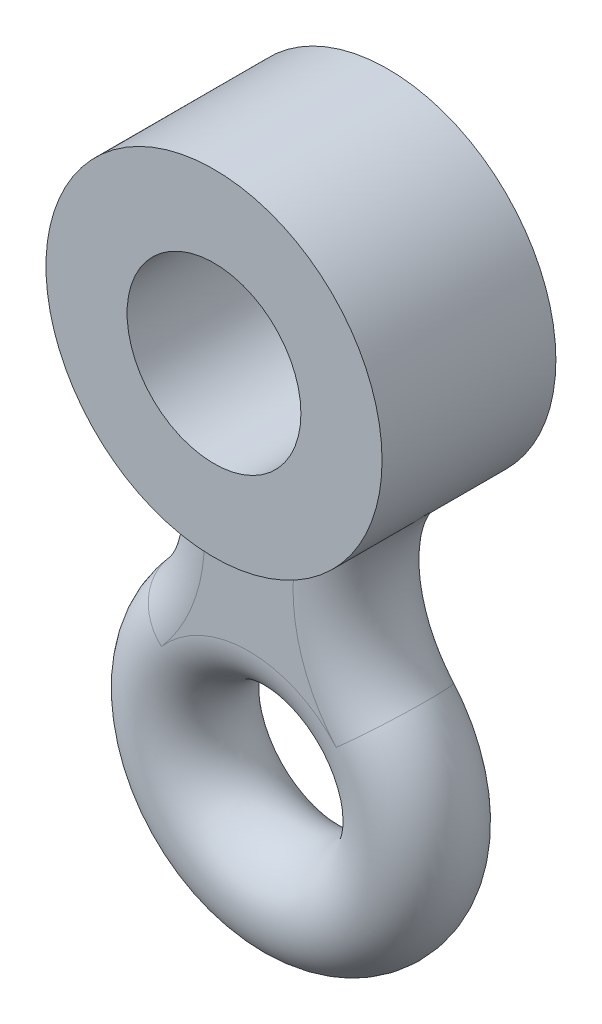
ISO-10303-21;
HEADER;
FILE_DESCRIPTION(('STEP AP214'),'2;1');
FILE_NAME('part.step','',(''),(''),'','','');
FILE_SCHEMA(('AUTOMOTIVE_DESIGN { 1 0 10303 214 1 1 1 1 }'));
ENDSEC;
DATA;
#1=APPLICATION_CONTEXT('core data for automotive mechanical design processes');
#2=APPLICATION_PROTOCOL_DEFINITION('international standard','automotive_design',2000,#1);
#3=PRODUCT_CONTEXT('',#1,'mechanical');
#4=PRODUCT('Part','Part','',(#3));
#5=PRODUCT_RELATED_PRODUCT_CATEGORY('part','',(#4));
#6=PRODUCT_DEFINITION_FORMATION('','',#4);
#7=PRODUCT_DEFINITION_CONTEXT('part definition',#1,'design');
#8=PRODUCT_DEFINITION('design','',#6,#7);
#9=PRODUCT_DEFINITION_SHAPE('','',#8);
#10=(LENGTH_UNIT() NAMED_UNIT(*) SI_UNIT(.MILLI.,.METRE.));
#11=(NAMED_UNIT(*) PLANE_ANGLE_UNIT() SI_UNIT($,.RADIAN.));
#12=(NAMED_UNIT(*) SI_UNIT($,.STERADIAN.) SOLID_ANGLE_UNIT());
#13=UNCERTAINTY_MEASURE_WITH_UNIT(LENGTH_MEASURE(1.E-05),#10,'distance_accuracy_value','');
#14=(GEOMETRIC_REPRESENTATION_CONTEXT(3) GLOBAL_UNCERTAINTY_ASSIGNED_CONTEXT((#13)) GLOBAL_UNIT_ASSIGNED_CONTEXT((#10,
#11,#12)) REPRESENTATION_CONTEXT('',''));
#15=CARTESIAN_POINT('',(0.,0.,0.));
#16=DIRECTION('',(0.,0.,1.));
#17=DIRECTION('',(1.,0.,0.));
#18=AXIS2_PLACEMENT_3D('',#15,#16,#17);
#19=CARTESIAN_POINT('',(-37.8307489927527,32.9828823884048,0.));
#20=DIRECTION('',(0.,0.,-1.));
#21=DIRECTION('',(-1.,0.,0.));
#22=AXIS2_PLACEMENT_3D('',#19,#20,#21);
#23=TOROIDAL_SURFACE('',#22,30.19,9.);
#24=CARTESIAN_POINT('',(-15.0750145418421,13.1432087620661,0.));
#25=DIRECTION('',(-0.657160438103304,-0.753750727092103,0.));
#26=DIRECTION('',(0.753750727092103,-0.657160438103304,0.));
#27=AXIS2_PLACEMENT_3D('',#24,#25,#26);
#28=CIRCLE('',#27,9.);
#29=CARTESIAN_POINT('',(-15.0750145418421,13.1432087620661,9.));
#30=VERTEX_POINT('',#29);
#31=CARTESIAN_POINT('',(-15.0750145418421,13.1432087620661,-9.));
#32=VERTEX_POINT('',#31);
#33=EDGE_CURVE('E169',#30,#32,#28,.T.);
#34=ORIENTED_EDGE('',*,*,#33,.F.);
#35=CARTESIAN_POINT('',(-37.8307489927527,32.9828823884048,9.));
#36=DIRECTION('',(0.,0.,-1.));
#37=DIRECTION('',(-1.,0.,0.));
#38=AXIS2_PLACEMENT_3D('',#35,#36,#37);
#39=CIRCLE('',#38,30.19);
#40=CARTESIAN_POINT('',(-8.08625121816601,38.1501787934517,9.));
#41=VERTEX_POINT('',#40);
#42=EDGE_CURVE('E120',#41,#30,#39,.T.);
#43=ORIENTED_EDGE('',*,*,#42,.F.);
#44=CARTESIAN_POINT('',(-21.8661295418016,46.9507905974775,-0.636456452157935));
#45=CARTESIAN_POINT('',(-21.8268102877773,46.9056497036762,-0.634297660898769));
#46=CARTESIAN_POINT('',(-21.7875867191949,46.8609148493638,-0.639080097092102));
#47=CARTESIAN_POINT('',(-21.7109463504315,46.7740277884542,-0.659109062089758));
#48=CARTESIAN_POINT('',(-21.6735087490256,46.7318396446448,-0.674108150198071));
#49=CARTESIAN_POINT('',(-21.5922890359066,46.6408267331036,-0.715340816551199));
#50=CARTESIAN_POINT('',(-21.5488671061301,46.5925178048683,-0.743293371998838));
#51=CARTESIAN_POINT('',(-21.4636500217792,46.4983139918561,-0.805242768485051));
#52=CARTESIAN_POINT('',(-21.4218593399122,46.4524256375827,-0.839254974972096));
#53=CARTESIAN_POINT('',(-21.3384965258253,46.3614547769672,-0.91161127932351));
#54=CARTESIAN_POINT('',(-21.2969502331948,46.3164133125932,-0.950035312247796));
#55=CARTESIAN_POINT('',(-21.2146485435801,46.2277383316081,-1.02907964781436));
#56=CARTESIAN_POINT('',(-21.1738921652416,46.1841030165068,-1.06969695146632));
#57=CARTESIAN_POINT('',(-21.0396282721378,46.0412218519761,-1.20646347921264));
#58=CARTESIAN_POINT('',(-20.9469984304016,45.9440518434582,-1.30561882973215));
#59=CARTESIAN_POINT('',(-20.7619479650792,45.7525513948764,-1.50683848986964));
#60=CARTESIAN_POINT('',(-20.6695274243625,45.6582219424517,-1.60890378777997));
#61=CARTESIAN_POINT('',(-20.4840376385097,45.4714455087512,-1.81447457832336));
#62=CARTESIAN_POINT('',(-20.3909677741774,45.3790007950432,-1.9179815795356));
#63=CARTESIAN_POINT('',(-20.2038753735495,45.1956602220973,-2.12545822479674));
#64=CARTESIAN_POINT('',(-20.1098529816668,45.104764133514,-2.22942779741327));
#65=CARTESIAN_POINT('',(-19.827857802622,44.8358047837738,-2.5392177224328));
#66=CARTESIAN_POINT('',(-19.6380914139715,44.6595928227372,-2.7450235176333));
#67=CARTESIAN_POINT('',(-19.2526685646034,44.3112451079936,-3.15434145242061));
#68=CARTESIAN_POINT('',(-19.0570143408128,44.1391078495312,-3.3578544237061));
#69=CARTESIAN_POINT('',(-18.453416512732,43.6224330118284,-3.9696386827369));
#70=CARTESIAN_POINT('',(-18.0349069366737,43.2834424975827,-4.37231675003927));
#71=CARTESIAN_POINT('',(-17.1646745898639,42.6189495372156,-5.15309951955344));
#72=CARTESIAN_POINT('',(-16.7129337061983,42.2934546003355,-5.53119060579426));
#73=CARTESIAN_POINT('',(-15.7717353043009,41.6571304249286,-6.2519915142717));
#74=CARTESIAN_POINT('',(-15.2822638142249,41.3463066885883,-6.59468811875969));
#75=CARTESIAN_POINT('',(-14.2623212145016,40.7425973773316,-7.23116258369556));
#76=CARTESIAN_POINT('',(-13.7318992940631,40.4496910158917,-7.52499783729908));
#77=CARTESIAN_POINT('',(-12.9142298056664,40.0324827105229,-7.91237400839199));
#78=CARTESIAN_POINT('',(-12.6431800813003,39.8993658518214,-8.03087963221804));
#79=CARTESIAN_POINT('',(-12.0913297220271,39.6391813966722,-8.25066734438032));
#80=CARTESIAN_POINT('',(-11.8105300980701,39.5121131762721,-8.35195121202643));
#81=CARTESIAN_POINT('',(-11.2397953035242,39.2649359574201,-8.53499398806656));
#82=CARTESIAN_POINT('',(-10.9498648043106,39.1448234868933,-8.61676270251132));
#83=CARTESIAN_POINT('',(-10.361658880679,38.9124387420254,-8.75845865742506));
#84=CARTESIAN_POINT('',(-10.0633851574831,38.8001648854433,-8.8183903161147));
#85=CARTESIAN_POINT('',(-9.45630604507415,38.5831557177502,-8.91458248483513));
#86=CARTESIAN_POINT('',(-9.14741877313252,38.4785225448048,-8.95056137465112));
#87=CARTESIAN_POINT('',(-8.52443066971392,38.2792315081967,-8.99532477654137));
#88=CARTESIAN_POINT('',(-8.21032978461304,38.1845737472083,-9.00410900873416));
#89=CARTESIAN_POINT('',(-7.5797286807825,38.006161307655,-8.9923248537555));
#90=CARTESIAN_POINT('',(-7.26322993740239,37.9224004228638,-8.97177325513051));
#91=CARTESIAN_POINT('',(-6.63091962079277,37.7663874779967,-8.89961114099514));
#92=CARTESIAN_POINT('',(-6.31510794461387,37.6941335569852,-8.848005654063));
#93=CARTESIAN_POINT('',(-5.72125562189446,37.5685145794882,-8.71982266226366));
#94=CARTESIAN_POINT('',(-5.44276695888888,37.5139582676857,-8.64648093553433));
#95=CARTESIAN_POINT('',(-4.89222244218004,37.4142624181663,-8.4737908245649));
#96=CARTESIAN_POINT('',(-4.62016625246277,37.3691223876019,-8.37444380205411));
#97=CARTESIAN_POINT('',(-4.08562568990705,37.2879688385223,-8.14998787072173));
#98=CARTESIAN_POINT('',(-3.82313695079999,37.25195111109,-8.0248908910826));
#99=CARTESIAN_POINT('',(-3.31059376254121,37.1884286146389,-7.74960372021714));
#100=CARTESIAN_POINT('',(-3.06053785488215,37.1609228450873,-7.59941648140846));
#101=CARTESIAN_POINT('',(-2.60950161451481,37.116882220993,-7.29773495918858));
#102=CARTESIAN_POINT('',(-2.40653771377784,37.0993527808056,-7.14933800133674));
#103=CARTESIAN_POINT('',(-2.01358490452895,37.0693190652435,-6.83580224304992));
#104=CARTESIAN_POINT('',(-1.82359540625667,37.0568145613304,-6.67066420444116));
#105=CARTESIAN_POINT('',(-1.45816629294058,37.036104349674,-6.32484646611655));
#106=CARTESIAN_POINT('',(-1.2827234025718,37.0278976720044,-6.1441702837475));
#107=CARTESIAN_POINT('',(-0.947697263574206,37.0150041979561,-5.76854591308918));
#108=CARTESIAN_POINT('',(-0.788114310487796,37.0103174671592,-5.57359745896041));
#109=CARTESIAN_POINT('',(-0.489061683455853,37.0037460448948,-5.17492798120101));
#110=CARTESIAN_POINT('',(-0.349251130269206,37.0018067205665,-4.97146335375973));
#111=CARTESIAN_POINT('',(-0.086936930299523,36.999833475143,-4.55356454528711));
#112=CARTESIAN_POINT('',(0.0355608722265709,36.9998001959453,-4.33912669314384));
#113=CARTESIAN_POINT('',(0.262350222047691,37.0009649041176,-3.90087502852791));
#114=CARTESIAN_POINT('',(0.366644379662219,37.0021627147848,-3.67706256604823));
#115=CARTESIAN_POINT('',(0.556365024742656,37.005182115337,-3.22158165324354));
#116=CARTESIAN_POINT('',(0.641791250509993,37.007003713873,-2.98991309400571));
#117=CARTESIAN_POINT('',(0.794338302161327,37.0107788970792,-2.51686439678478));
#118=CARTESIAN_POINT('',(0.861171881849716,37.0127340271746,-2.27539160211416));
#119=CARTESIAN_POINT('',(0.974412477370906,37.0163195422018,-1.78769310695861));
#120=CARTESIAN_POINT('',(1.02081875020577,37.0179499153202,-1.54146723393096));
#121=CARTESIAN_POINT('',(1.09290471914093,37.0205786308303,-1.04598395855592));
#122=CARTESIAN_POINT('',(1.11858337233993,37.0215769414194,-0.796726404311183));
#123=CARTESIAN_POINT('',(1.14904549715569,37.0227688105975,-0.296943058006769));
#124=CARTESIAN_POINT('',(1.15382951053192,37.0229623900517,-0.0464172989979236));
#125=CARTESIAN_POINT('',(1.14242882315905,37.0225106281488,0.456110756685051));
#126=CARTESIAN_POINT('',(1.1260804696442,37.0218587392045,0.708109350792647));
#127=CARTESIAN_POINT('',(1.07223782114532,37.0198166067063,1.20983407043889));
#128=CARTESIAN_POINT('',(1.03474351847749,37.0184263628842,1.45956019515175));
#129=CARTESIAN_POINT('',(0.938842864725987,37.0151613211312,1.95501832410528));
#130=CARTESIAN_POINT('',(0.880431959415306,37.0132864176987,2.20074944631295));
#131=CARTESIAN_POINT('',(0.743109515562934,37.0094411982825,2.68631542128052));
#132=CARTESIAN_POINT('',(0.664205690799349,37.007470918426,2.92615245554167));
#133=CARTESIAN_POINT('',(0.486408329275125,37.0039432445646,3.39831779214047));
#134=CARTESIAN_POINT('',(0.387513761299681,37.0023858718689,3.63064570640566));
#135=CARTESIAN_POINT('',(0.170409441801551,37.000297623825,4.08610172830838));
#136=CARTESIAN_POINT('',(0.0521996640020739,36.9997667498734,4.30922982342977));
#137=CARTESIAN_POINT('',(-0.202705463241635,37.0004285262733,4.74465200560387));
#138=CARTESIAN_POINT('',(-0.339400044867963,37.0016211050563,4.95694654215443));
#139=CARTESIAN_POINT('',(-0.630295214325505,37.0064855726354,5.36915355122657));
#140=CARTESIAN_POINT('',(-0.784495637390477,37.0101574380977,5.56906614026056));
#141=CARTESIAN_POINT('',(-1.10784652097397,37.0207210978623,5.95336651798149));
#142=CARTESIAN_POINT('',(-1.27685583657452,37.0275847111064,6.13787383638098));
#143=CARTESIAN_POINT('',(-1.62966791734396,37.0452876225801,6.4919505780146));
#144=CARTESIAN_POINT('',(-1.81347057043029,37.0561268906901,6.6615201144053));
#145=CARTESIAN_POINT('',(-2.19438820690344,37.0825123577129,6.98449863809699));
#146=CARTESIAN_POINT('',(-2.39150054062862,37.0980576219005,7.13791082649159));
#147=CARTESIAN_POINT('',(-2.79747448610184,37.1345247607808,7.42758827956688));
#148=CARTESIAN_POINT('',(-3.00633596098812,37.1554465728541,7.56385374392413));
#149=CARTESIAN_POINT('',(-3.430985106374,37.2028939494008,7.81657275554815));
#150=CARTESIAN_POINT('',(-3.64662876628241,37.229334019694,7.93328451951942));
#151=CARTESIAN_POINT('',(-4.08590651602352,37.2884261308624,8.14868975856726));
#152=CARTESIAN_POINT('',(-4.30954047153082,37.3210780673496,8.24738353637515));
#153=CARTESIAN_POINT('',(-4.76299566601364,37.39289319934,8.4264257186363));
#154=CARTESIAN_POINT('',(-4.99281653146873,37.4320560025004,8.50677522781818));
#155=CARTESIAN_POINT('',(-5.45687227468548,37.5170544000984,8.64906991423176));
#156=CARTESIAN_POINT('',(-5.691107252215,37.5628901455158,8.71101467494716));
#157=CARTESIAN_POINT('',(-6.16676631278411,37.6621958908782,8.81769423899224));
#158=CARTESIAN_POINT('',(-6.40824217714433,37.7157952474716,8.86207685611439));
#159=CARTESIAN_POINT('',(-6.89224389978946,37.8298243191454,8.93236304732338));
#160=CARTESIAN_POINT('',(-7.13476974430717,37.8902539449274,8.95826686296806));
#161=CARTESIAN_POINT('',(-7.6193606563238,38.0177177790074,8.99227082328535));
#162=CARTESIAN_POINT('',(-7.86142564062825,38.0847530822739,9.0003680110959));
#163=CARTESIAN_POINT('',(-8.34372021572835,38.2250929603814,8.99960608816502));
#164=CARTESIAN_POINT('',(-8.58394942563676,38.2983987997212,8.99074354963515));
#165=CARTESIAN_POINT('',(-9.15530943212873,38.4808773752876,8.95039911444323));
#166=CARTESIAN_POINT('',(-9.48504187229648,38.5928194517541,8.91139350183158));
#167=CARTESIAN_POINT('',(-10.136249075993,38.8269190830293,8.80525747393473));
#168=CARTESIAN_POINT('',(-10.4577210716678,38.9490800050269,8.73811775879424));
#169=CARTESIAN_POINT('',(-11.0912509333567,39.2025977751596,8.57860746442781));
#170=CARTESIAN_POINT('',(-11.4032913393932,39.3339703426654,8.48619293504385));
#171=CARTESIAN_POINT('',(-12.0163307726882,39.6045436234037,8.27917772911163));
#172=CARTESIAN_POINT('',(-12.3173296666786,39.7437444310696,8.16457678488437));
#173=CARTESIAN_POINT('',(-13.066909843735,40.1057854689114,7.84902046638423));
#174=CARTESIAN_POINT('',(-13.5076729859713,40.3332971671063,7.63479692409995));
#175=CARTESIAN_POINT('',(-14.3620349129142,40.8013965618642,7.16957260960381));
#176=CARTESIAN_POINT('',(-14.7756161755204,41.0419925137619,6.91854844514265));
#177=CARTESIAN_POINT('',(-15.5772010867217,41.5342633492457,6.38726443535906));
#178=CARTESIAN_POINT('',(-15.9651764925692,41.785949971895,6.10697316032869));
#179=CARTESIAN_POINT('',(-16.7169680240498,42.2987348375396,5.52403251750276));
#180=CARTESIAN_POINT('',(-17.0807904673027,42.5598305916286,5.22138904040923));
#181=CARTESIAN_POINT('',(-17.8305248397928,43.1238320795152,4.56069706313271));
#182=CARTESIAN_POINT('',(-18.2135892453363,43.4279101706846,4.20042962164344));
#183=CARTESIAN_POINT('',(-18.7701947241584,43.8925805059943,3.64977150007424));
#184=CARTESIAN_POINT('',(-18.9526518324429,44.0488225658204,3.46459653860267));
#185=CARTESIAN_POINT('',(-19.3122039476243,44.364472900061,3.09174464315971));
#186=CARTESIAN_POINT('',(-19.4892989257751,44.5238811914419,2.90406769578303));
#187=CARTESIAN_POINT('',(-19.8471744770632,44.854035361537,2.51834322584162));
#188=CARTESIAN_POINT('',(-20.0277224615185,45.0249577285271,2.32023116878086));
#189=CARTESIAN_POINT('',(-20.2955371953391,45.2851114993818,2.02393226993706));
#190=CARTESIAN_POINT('',(-20.3842624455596,45.3724116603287,1.92536160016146));
#191=CARTESIAN_POINT('',(-20.5610487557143,45.5486218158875,1.72906792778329));
#192=CARTESIAN_POINT('',(-20.6491098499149,45.6375317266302,1.63134488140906));
#193=CARTESIAN_POINT('',(-20.826900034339,45.8193972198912,1.43587155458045));
#194=CARTESIAN_POINT('',(-20.9166264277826,45.9123983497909,1.33816154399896));
#195=CARTESIAN_POINT('',(-21.0973967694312,46.1023311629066,1.14665661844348));
#196=CARTESIAN_POINT('',(-21.1884443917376,46.1992762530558,1.05287772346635));
#197=CARTESIAN_POINT('',(-21.3329200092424,46.3553515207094,0.916567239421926));
#198=CARTESIAN_POINT('',(-21.3849838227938,46.4120278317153,0.869857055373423));
#199=CARTESIAN_POINT('',(-21.490876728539,46.5282668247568,0.783931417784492));
#200=CARTESIAN_POINT('',(-21.5446842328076,46.5877968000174,0.744648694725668));
#201=CARTESIAN_POINT('',(-21.6425061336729,46.6969989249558,0.688283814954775));
#202=CARTESIAN_POINT('',(-21.6857722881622,46.7456088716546,0.668136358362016));
#203=CARTESIAN_POINT('',(-21.7746073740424,46.8461185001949,0.640783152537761));
#204=CARTESIAN_POINT('',(-21.8202059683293,46.898066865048,0.633869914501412));
#205=CARTESIAN_POINT('',(-21.8661295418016,46.9507905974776,0.636456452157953));
#206=B_SPLINE_CURVE_WITH_KNOTS('',3,(#44,#45,#46,#47,#48,#49,#50,#51,#52,#53,#54,#55,#56,#57,
#58,#59,#60,#61,#62,#63,#64,#65,#66,#67,#68,#69,#70,#71,#72,#73,#74,#75,#76,#77,#78,#79,#80,#81,
#82,#83,#84,#85,#86,#87,#88,#89,#90,#91,#92,#93,#94,#95,#96,#97,#98,#99,#100,#101,#102,#103,
#104,#105,#106,#107,#108,#109,#110,#111,#112,#113,#114,#115,#116,#117,#118,#119,#120,#121,#122,
#123,#124,#125,#126,#127,#128,#129,#130,#131,#132,#133,#134,#135,#136,#137,#138,#139,#140,#141,
#142,#143,#144,#145,#146,#147,#148,#149,#150,#151,#152,#153,#154,#155,#156,#157,#158,#159,#160,
#161,#162,#163,#164,#165,#166,#167,#168,#169,#170,#171,#172,#173,#174,#175,#176,#177,#178,#179,
#180,#181,#182,#183,#184,#185,#186,#187,#188,#189,#190,#191,#192,#193,#194,#195,#196,#197,#198,
#199,#200,#201,#202,#203,#204,#205),.UNSPECIFIED.,.F.,.F.,(4,2,2,2,2,2,2,2,2,2,2,2,2,2,2,2,2,2,
2,2,2,2,2,2,2,2,2,2,2,2,2,2,2,2,2,2,2,2,2,2,2,2,2,2,2,2,2,2,2,2,2,2,2,2,2,2,2,2,2,2,2,2,2,2,2,2,
2,2,2,2,2,2,2,2,2,2,2,2,2,2,4),(0.,0.178430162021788,0.352685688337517,0.564293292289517,
0.776445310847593,0.99334701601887,1.20995929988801,1.71049251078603,2.21119778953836,
2.71247362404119,3.21367456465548,4.20593411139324,5.19782131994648,7.21406173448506,
9.2314093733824,11.2495076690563,13.2652184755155,14.2378631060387,15.2104071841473,
16.182461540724,17.1543191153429,18.1374103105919,19.1205116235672,20.1030505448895,
21.0854304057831,21.9634344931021,22.841392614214,23.7189449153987,24.5963940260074,
25.3515952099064,26.1067620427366,26.8617583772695,27.616768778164,28.3565441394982,
29.0965686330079,29.8364869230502,30.5764154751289,31.3272102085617,32.07803224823,
32.8288920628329,33.5797324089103,34.3364223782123,35.0931126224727,35.8499677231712,
36.6065383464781,37.3631480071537,38.1197586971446,38.8763379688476,39.6329101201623,
40.3829254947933,41.1329351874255,41.8827960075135,42.6326480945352,43.3716465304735,
44.1106325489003,44.8495740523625,45.5885322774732,46.3416377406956,47.094733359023,
47.8479540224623,48.6013269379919,49.6509255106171,50.7008713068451,51.7526545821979,
52.804450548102,54.4226798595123,56.0419422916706,57.662961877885,59.2835557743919,
61.1049244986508,62.0147750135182,62.9246304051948,63.8782591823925,64.3545810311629,
64.8308781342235,65.316910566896,65.8047618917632,66.0746772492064,66.3420167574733,
66.5452068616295,66.7528383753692),.UNSPECIFIED.);
#207=CARTESIAN_POINT('',(-21.8489742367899,46.9311163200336,0.636064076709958));
#208=VERTEX_POINT('',#207);
#209=EDGE_CURVE('E95',#41,#208,#206,.T.);
#210=ORIENTED_EDGE('',*,*,#209,.T.);
#211=CARTESIAN_POINT('',(-15.0852133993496,52.8342478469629,0.));
#212=DIRECTION('',(0.657547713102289,-0.753412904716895,0.));
#213=DIRECTION('',(0.753412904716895,0.657547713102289,0.));
#214=AXIS2_PLACEMENT_3D('',#211,#212,#213);
#215=CIRCLE('',#214,9.);
#216=CARTESIAN_POINT('',(-21.8489742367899,46.9311163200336,-0.636064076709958));
#217=VERTEX_POINT('',#216);
#218=EDGE_CURVE('E44',#208,#217,#215,.T.);
#219=ORIENTED_EDGE('',*,*,#218,.T.);
#220=CARTESIAN_POINT('',(-8.086251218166,38.1501787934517,-9.00000000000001));
#221=VERTEX_POINT('',#220);
#222=EDGE_CURVE('E180',#217,#221,#206,.T.);
#223=ORIENTED_EDGE('',*,*,#222,.T.);
#224=CARTESIAN_POINT('',(-37.8307489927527,32.9828823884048,-9.));
#225=DIRECTION('',(0.,0.,-1.));
#226=DIRECTION('',(-1.,0.,0.));
#227=AXIS2_PLACEMENT_3D('',#224,#225,#226);
#228=CIRCLE('',#227,30.19);
#229=EDGE_CURVE('E110',#221,#32,#228,.T.);
#230=ORIENTED_EDGE('',*,*,#229,.T.);
#231=EDGE_LOOP('',(#34,#43,#210,#219,#223,#230));
#232=FACE_BOUND('',#231,.T.);
#233=ADVANCED_FACE('F35',(#232),#23,.T.);
#234=CARTESIAN_POINT('',(37.8307489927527,32.9828823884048,0.));
#235=DIRECTION('',(0.,0.,1.));
#236=DIRECTION('',(1.,0.,0.));
#237=AXIS2_PLACEMENT_3D('',#234,#235,#236);
#238=TOROIDAL_SURFACE('',#237,30.19,9.);
#239=CARTESIAN_POINT('',(21.8661295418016,46.9507905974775,-0.636456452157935));
#240=CARTESIAN_POINT('',(21.8268102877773,46.9056497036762,-0.634297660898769));
#241=CARTESIAN_POINT('',(21.7875867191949,46.8609148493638,-0.639080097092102));
#242=CARTESIAN_POINT('',(21.7109463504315,46.7740277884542,-0.659109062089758));
#243=CARTESIAN_POINT('',(21.6735087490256,46.7318396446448,-0.674108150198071));
#244=CARTESIAN_POINT('',(21.5922890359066,46.6408267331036,-0.715340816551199));
#245=CARTESIAN_POINT('',(21.5488671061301,46.5925178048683,-0.743293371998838));
#246=CARTESIAN_POINT('',(21.4636500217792,46.4983139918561,-0.805242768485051));
#247=CARTESIAN_POINT('',(21.4218593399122,46.4524256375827,-0.839254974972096));
#248=CARTESIAN_POINT('',(21.3384965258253,46.3614547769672,-0.91161127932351));
#249=CARTESIAN_POINT('',(21.2969502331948,46.3164133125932,-0.950035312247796));
#250=CARTESIAN_POINT('',(21.2146485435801,46.2277383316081,-1.02907964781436));
#251=CARTESIAN_POINT('',(21.1738921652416,46.1841030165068,-1.06969695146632));
#252=CARTESIAN_POINT('',(21.0396282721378,46.0412218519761,-1.20646347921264));
#253=CARTESIAN_POINT('',(20.9469984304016,45.9440518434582,-1.30561882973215));
#254=CARTESIAN_POINT('',(20.7619479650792,45.7525513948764,-1.50683848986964));
#255=CARTESIAN_POINT('',(20.6695274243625,45.6582219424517,-1.60890378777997));
#256=CARTESIAN_POINT('',(20.4840376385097,45.4714455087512,-1.81447457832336));
#257=CARTESIAN_POINT('',(20.3909677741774,45.3790007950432,-1.9179815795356));
#258=CARTESIAN_POINT('',(20.2038753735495,45.1956602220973,-2.12545822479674));
#259=CARTESIAN_POINT('',(20.1098529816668,45.104764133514,-2.22942779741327));
#260=CARTESIAN_POINT('',(19.827857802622,44.8358047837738,-2.5392177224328));
#261=CARTESIAN_POINT('',(19.6380914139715,44.6595928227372,-2.7450235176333));
#262=CARTESIAN_POINT('',(19.2526685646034,44.3112451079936,-3.15434145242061));
#263=CARTESIAN_POINT('',(19.0570143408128,44.1391078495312,-3.3578544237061));
#264=CARTESIAN_POINT('',(18.453416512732,43.6224330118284,-3.9696386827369));
#265=CARTESIAN_POINT('',(18.0349069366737,43.2834424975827,-4.37231675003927));
#266=CARTESIAN_POINT('',(17.1646745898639,42.6189495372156,-5.15309951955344));
#267=CARTESIAN_POINT('',(16.7129337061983,42.2934546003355,-5.53119060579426));
#268=CARTESIAN_POINT('',(15.7717353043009,41.6571304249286,-6.2519915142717));
#269=CARTESIAN_POINT('',(15.2822638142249,41.3463066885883,-6.59468811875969));
#270=CARTESIAN_POINT('',(14.2623212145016,40.7425973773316,-7.23116258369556));
#271=CARTESIAN_POINT('',(13.7318992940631,40.4496910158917,-7.52499783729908));
#272=CARTESIAN_POINT('',(12.9142298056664,40.0324827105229,-7.91237400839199));
#273=CARTESIAN_POINT('',(12.6431800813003,39.8993658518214,-8.03087963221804));
#274=CARTESIAN_POINT('',(12.0913297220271,39.6391813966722,-8.25066734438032));
#275=CARTESIAN_POINT('',(11.8105300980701,39.5121131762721,-8.35195121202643));
#276=CARTESIAN_POINT('',(11.2397953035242,39.2649359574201,-8.53499398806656));
#277=CARTESIAN_POINT('',(10.9498648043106,39.1448234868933,-8.61676270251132));
#278=CARTESIAN_POINT('',(10.361658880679,38.9124387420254,-8.75845865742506));
#279=CARTESIAN_POINT('',(10.0633851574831,38.8001648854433,-8.8183903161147));
#280=CARTESIAN_POINT('',(9.45630604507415,38.5831557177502,-8.91458248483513));
#281=CARTESIAN_POINT('',(9.14741877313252,38.4785225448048,-8.95056137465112));
#282=CARTESIAN_POINT('',(8.52443066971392,38.2792315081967,-8.99532477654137));
#283=CARTESIAN_POINT('',(8.21032978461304,38.1845737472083,-9.00410900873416));
#284=CARTESIAN_POINT('',(7.5797286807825,38.006161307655,-8.9923248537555));
#285=CARTESIAN_POINT('',(7.26322993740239,37.9224004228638,-8.97177325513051));
#286=CARTESIAN_POINT('',(6.63091962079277,37.7663874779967,-8.89961114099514));
#287=CARTESIAN_POINT('',(6.31510794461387,37.6941335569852,-8.848005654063));
#288=CARTESIAN_POINT('',(5.72125562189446,37.5685145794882,-8.71982266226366));
#289=CARTESIAN_POINT('',(5.44276695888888,37.5139582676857,-8.64648093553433));
#290=CARTESIAN_POINT('',(4.89222244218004,37.4142624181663,-8.4737908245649));
#291=CARTESIAN_POINT('',(4.62016625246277,37.3691223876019,-8.37444380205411));
#292=CARTESIAN_POINT('',(4.08562568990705,37.2879688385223,-8.14998787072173));
#293=CARTESIAN_POINT('',(3.82313695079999,37.25195111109,-8.0248908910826));
#294=CARTESIAN_POINT('',(3.31059376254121,37.1884286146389,-7.74960372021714));
#295=CARTESIAN_POINT('',(3.06053785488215,37.1609228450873,-7.59941648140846));
#296=CARTESIAN_POINT('',(2.60950161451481,37.116882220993,-7.29773495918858));
#297=CARTESIAN_POINT('',(2.40653771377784,37.0993527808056,-7.14933800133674));
#298=CARTESIAN_POINT('',(2.01358490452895,37.0693190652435,-6.83580224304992));
#299=CARTESIAN_POINT('',(1.82359540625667,37.0568145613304,-6.67066420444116));
#300=CARTESIAN_POINT('',(1.45816629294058,37.036104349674,-6.32484646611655));
#301=CARTESIAN_POINT('',(1.2827234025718,37.0278976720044,-6.1441702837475));
#302=CARTESIAN_POINT('',(0.947697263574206,37.0150041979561,-5.76854591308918));
#303=CARTESIAN_POINT('',(0.788114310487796,37.0103174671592,-5.57359745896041));
#304=CARTESIAN_POINT('',(0.489061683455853,37.0037460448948,-5.17492798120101));
#305=CARTESIAN_POINT('',(0.349251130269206,37.0018067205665,-4.97146335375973));
#306=CARTESIAN_POINT('',(0.086936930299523,36.999833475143,-4.55356454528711));
#307=CARTESIAN_POINT('',(-0.0355608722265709,36.9998001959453,-4.33912669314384));
#308=CARTESIAN_POINT('',(-0.262350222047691,37.0009649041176,-3.90087502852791));
#309=CARTESIAN_POINT('',(-0.366644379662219,37.0021627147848,-3.67706256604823));
#310=CARTESIAN_POINT('',(-0.556365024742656,37.005182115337,-3.22158165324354));
#311=CARTESIAN_POINT('',(-0.641791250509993,37.007003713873,-2.98991309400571));
#312=CARTESIAN_POINT('',(-0.794338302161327,37.0107788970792,-2.51686439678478));
#313=CARTESIAN_POINT('',(-0.861171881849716,37.0127340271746,-2.27539160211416));
#314=CARTESIAN_POINT('',(-0.974412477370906,37.0163195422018,-1.78769310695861));
#315=CARTESIAN_POINT('',(-1.02081875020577,37.0179499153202,-1.54146723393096));
#316=CARTESIAN_POINT('',(-1.09290471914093,37.0205786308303,-1.04598395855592));
#317=CARTESIAN_POINT('',(-1.11858337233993,37.0215769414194,-0.796726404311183));
#318=CARTESIAN_POINT('',(-1.14904549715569,37.0227688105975,-0.296943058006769));
#319=CARTESIAN_POINT('',(-1.15382951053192,37.0229623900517,-0.0464172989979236));
#320=CARTESIAN_POINT('',(-1.14242882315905,37.0225106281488,0.456110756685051));
#321=CARTESIAN_POINT('',(-1.1260804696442,37.0218587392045,0.708109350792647));
#322=CARTESIAN_POINT('',(-1.07223782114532,37.0198166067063,1.20983407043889));
#323=CARTESIAN_POINT('',(-1.03474351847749,37.0184263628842,1.45956019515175));
#324=CARTESIAN_POINT('',(-0.938842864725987,37.0151613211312,1.95501832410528));
#325=CARTESIAN_POINT('',(-0.880431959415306,37.0132864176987,2.20074944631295));
#326=CARTESIAN_POINT('',(-0.743109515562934,37.0094411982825,2.68631542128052));
#327=CARTESIAN_POINT('',(-0.664205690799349,37.007470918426,2.92615245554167));
#328=CARTESIAN_POINT('',(-0.486408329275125,37.0039432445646,3.39831779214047));
#329=CARTESIAN_POINT('',(-0.387513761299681,37.0023858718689,3.63064570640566));
#330=CARTESIAN_POINT('',(-0.170409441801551,37.000297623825,4.08610172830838));
#331=CARTESIAN_POINT('',(-0.0521996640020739,36.9997667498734,4.30922982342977));
#332=CARTESIAN_POINT('',(0.202705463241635,37.0004285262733,4.74465200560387));
#333=CARTESIAN_POINT('',(0.339400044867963,37.0016211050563,4.95694654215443));
#334=CARTESIAN_POINT('',(0.630295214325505,37.0064855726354,5.36915355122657));
#335=CARTESIAN_POINT('',(0.784495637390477,37.0101574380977,5.56906614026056));
#336=CARTESIAN_POINT('',(1.10784652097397,37.0207210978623,5.95336651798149));
#337=CARTESIAN_POINT('',(1.27685583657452,37.0275847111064,6.13787383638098));
#338=CARTESIAN_POINT('',(1.62966791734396,37.0452876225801,6.4919505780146));
#339=CARTESIAN_POINT('',(1.81347057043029,37.0561268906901,6.6615201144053));
#340=CARTESIAN_POINT('',(2.19438820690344,37.0825123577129,6.98449863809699));
#341=CARTESIAN_POINT('',(2.39150054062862,37.0980576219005,7.13791082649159));
#342=CARTESIAN_POINT('',(2.79747448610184,37.1345247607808,7.42758827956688));
#343=CARTESIAN_POINT('',(3.00633596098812,37.1554465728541,7.56385374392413));
#344=CARTESIAN_POINT('',(3.430985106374,37.2028939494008,7.81657275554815));
#345=CARTESIAN_POINT('',(3.64662876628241,37.229334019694,7.93328451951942));
#346=CARTESIAN_POINT('',(4.08590651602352,37.2884261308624,8.14868975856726));
#347=CARTESIAN_POINT('',(4.30954047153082,37.3210780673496,8.24738353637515));
#348=CARTESIAN_POINT('',(4.76299566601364,37.39289319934,8.4264257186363));
#349=CARTESIAN_POINT('',(4.99281653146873,37.4320560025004,8.50677522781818));
#350=CARTESIAN_POINT('',(5.45687227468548,37.5170544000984,8.64906991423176));
#351=CARTESIAN_POINT('',(5.691107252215,37.5628901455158,8.71101467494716));
#352=CARTESIAN_POINT('',(6.16676631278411,37.6621958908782,8.81769423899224));
#353=CARTESIAN_POINT('',(6.40824217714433,37.7157952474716,8.86207685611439));
#354=CARTESIAN_POINT('',(6.89224389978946,37.8298243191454,8.93236304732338));
#355=CARTESIAN_POINT('',(7.13476974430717,37.8902539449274,8.95826686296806));
#356=CARTESIAN_POINT('',(7.6193606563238,38.0177177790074,8.99227082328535));
#357=CARTESIAN_POINT('',(7.86142564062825,38.0847530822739,9.0003680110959));
#358=CARTESIAN_POINT('',(8.34372021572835,38.2250929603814,8.99960608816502));
#359=CARTESIAN_POINT('',(8.58394942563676,38.2983987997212,8.99074354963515));
#360=CARTESIAN_POINT('',(9.15530943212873,38.4808773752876,8.95039911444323));
#361=CARTESIAN_POINT('',(9.48504187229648,38.5928194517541,8.91139350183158));
#362=CARTESIAN_POINT('',(10.136249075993,38.8269190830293,8.80525747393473));
#363=CARTESIAN_POINT('',(10.4577210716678,38.9490800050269,8.73811775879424));
#364=CARTESIAN_POINT('',(11.0912509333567,39.2025977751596,8.57860746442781));
#365=CARTESIAN_POINT('',(11.4032913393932,39.3339703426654,8.48619293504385));
#366=CARTESIAN_POINT('',(12.0163307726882,39.6045436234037,8.27917772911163));
#367=CARTESIAN_POINT('',(12.3173296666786,39.7437444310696,8.16457678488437));
#368=CARTESIAN_POINT('',(13.066909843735,40.1057854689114,7.84902046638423));
#369=CARTESIAN_POINT('',(13.5076729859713,40.3332971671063,7.63479692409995));
#370=CARTESIAN_POINT('',(14.3620349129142,40.8013965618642,7.16957260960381));
#371=CARTESIAN_POINT('',(14.7756161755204,41.0419925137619,6.91854844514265));
#372=CARTESIAN_POINT('',(15.5772010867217,41.5342633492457,6.38726443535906));
#373=CARTESIAN_POINT('',(15.9651764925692,41.785949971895,6.10697316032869));
#374=CARTESIAN_POINT('',(16.7169680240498,42.2987348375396,5.52403251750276));
#375=CARTESIAN_POINT('',(17.0807904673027,42.5598305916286,5.22138904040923));
#376=CARTESIAN_POINT('',(17.8305248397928,43.1238320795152,4.56069706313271));
#377=CARTESIAN_POINT('',(18.2135892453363,43.4279101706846,4.20042962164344));
#378=CARTESIAN_POINT('',(18.7701947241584,43.8925805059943,3.64977150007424));
#379=CARTESIAN_POINT('',(18.9526518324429,44.0488225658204,3.46459653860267));
#380=CARTESIAN_POINT('',(19.3122039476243,44.364472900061,3.09174464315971));
#381=CARTESIAN_POINT('',(19.4892989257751,44.5238811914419,2.90406769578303));
#382=CARTESIAN_POINT('',(19.8471744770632,44.854035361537,2.51834322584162));
#383=CARTESIAN_POINT('',(20.0277224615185,45.0249577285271,2.32023116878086));
#384=CARTESIAN_POINT('',(20.2955371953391,45.2851114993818,2.02393226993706));
#385=CARTESIAN_POINT('',(20.3842624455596,45.3724116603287,1.92536160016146));
#386=CARTESIAN_POINT('',(20.5610487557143,45.5486218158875,1.72906792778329));
#387=CARTESIAN_POINT('',(20.6491098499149,45.6375317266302,1.63134488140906));
#388=CARTESIAN_POINT('',(20.826900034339,45.8193972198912,1.43587155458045));
#389=CARTESIAN_POINT('',(20.9166264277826,45.9123983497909,1.33816154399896));
#390=CARTESIAN_POINT('',(21.0973967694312,46.1023311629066,1.14665661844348));
#391=CARTESIAN_POINT('',(21.1884443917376,46.1992762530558,1.05287772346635));
#392=CARTESIAN_POINT('',(21.3329200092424,46.3553515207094,0.916567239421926));
#393=CARTESIAN_POINT('',(21.3849838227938,46.4120278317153,0.869857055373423));
#394=CARTESIAN_POINT('',(21.490876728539,46.5282668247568,0.783931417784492));
#395=CARTESIAN_POINT('',(21.5446842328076,46.5877968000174,0.744648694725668));
#396=CARTESIAN_POINT('',(21.6425061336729,46.6969989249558,0.688283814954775));
#397=CARTESIAN_POINT('',(21.6857722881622,46.7456088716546,0.668136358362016));
#398=CARTESIAN_POINT('',(21.7746073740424,46.8461185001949,0.640783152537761));
#399=CARTESIAN_POINT('',(21.8202059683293,46.898066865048,0.633869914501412));
#400=CARTESIAN_POINT('',(21.8661295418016,46.9507905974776,0.636456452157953));
#401=B_SPLINE_CURVE_WITH_KNOTS('',3,(#239,#240,#241,#242,#243,#244,#245,#246,#247,#248,#249,
#250,#251,#252,#253,#254,#255,#256,#257,#258,#259,#260,#261,#262,#263,#264,#265,#266,#267,#268,
#269,#270,#271,#272,#273,#274,#275,#276,#277,#278,#279,#280,#281,#282,#283,#284,#285,#286,#287,
#288,#289,#290,#291,#292,#293,#294,#295,#296,#297,#298,#299,#300,#301,#302,#303,#304,#305,#306,
#307,#308,#309,#310,#311,#312,#313,#314,#315,#316,#317,#318,#319,#320,#321,#322,#323,#324,#325,
#326,#327,#328,#329,#330,#331,#332,#333,#334,#335,#336,#337,#338,#339,#340,#341,#342,#343,#344,
#345,#346,#347,#348,#349,#350,#351,#352,#353,#354,#355,#356,#357,#358,#359,#360,#361,#362,#363,
#364,#365,#366,#367,#368,#369,#370,#371,#372,#373,#374,#375,#376,#377,#378,#379,#380,#381,#382,
#383,#384,#385,#386,#387,#388,#389,#390,#391,#392,#393,#394,#395,#396,#397,#398,#399,#400),
.UNSPECIFIED.,.F.,.F.,(4,2,2,2,2,2,2,2,2,2,2,2,2,2,2,2,2,2,2,2,2,2,2,2,2,2,2,2,2,2,2,2,2,2,2,2,
2,2,2,2,2,2,2,2,2,2,2,2,2,2,2,2,2,2,2,2,2,2,2,2,2,2,2,2,2,2,2,2,2,2,2,2,2,2,2,2,2,2,2,2,4),(0.,
0.178430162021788,0.352685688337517,0.564293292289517,0.776445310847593,0.99334701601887,
1.20995929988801,1.71049251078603,2.21119778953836,2.71247362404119,3.21367456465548,
4.20593411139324,5.19782131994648,7.21406173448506,9.2314093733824,11.2495076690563,
13.2652184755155,14.2378631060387,15.2104071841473,16.182461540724,17.1543191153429,
18.1374103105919,19.1205116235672,20.1030505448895,21.0854304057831,21.9634344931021,
22.841392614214,23.7189449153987,24.5963940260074,25.3515952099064,26.1067620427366,
26.8617583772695,27.616768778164,28.3565441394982,29.0965686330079,29.8364869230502,
30.5764154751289,31.3272102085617,32.07803224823,32.8288920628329,33.5797324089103,
34.3364223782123,35.0931126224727,35.8499677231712,36.6065383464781,37.3631480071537,
38.1197586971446,38.8763379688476,39.6329101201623,40.3829254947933,41.1329351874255,
41.8827960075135,42.6326480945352,43.3716465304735,44.1106325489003,44.8495740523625,
45.5885322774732,46.3416377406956,47.094733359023,47.8479540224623,48.6013269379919,
49.6509255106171,50.7008713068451,51.7526545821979,52.804450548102,54.4226798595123,
56.0419422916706,57.662961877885,59.2835557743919,61.1049244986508,62.0147750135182,
62.9246304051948,63.8782591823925,64.3545810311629,64.8308781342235,65.316910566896,
65.8047618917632,66.0746772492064,66.3420167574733,66.5452068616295,66.7528383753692),.UNSPECIFIED.);
#402=CARTESIAN_POINT('',(8.08625121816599,38.1501787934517,9.));
#403=VERTEX_POINT('',#402);
#404=CARTESIAN_POINT('',(21.8489742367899,46.9311163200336,0.636064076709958));
#405=VERTEX_POINT('',#404);
#406=EDGE_CURVE('E96',#403,#405,#401,.T.);
#407=ORIENTED_EDGE('',*,*,#406,.F.);
#408=CARTESIAN_POINT('',(37.8307489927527,32.9828823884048,9.));
#409=DIRECTION('',(0.,0.,-1.));
#410=DIRECTION('',(1.,0.,0.));
#411=AXIS2_PLACEMENT_3D('',#408,#409,#410);
#412=CIRCLE('',#411,30.19);
#413=CARTESIAN_POINT('',(15.0750145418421,13.1432087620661,9.));
#414=VERTEX_POINT('',#413);
#415=EDGE_CURVE('E51',#414,#403,#412,.T.);
#416=ORIENTED_EDGE('',*,*,#415,.F.);
#417=CARTESIAN_POINT('',(15.0750145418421,13.1432087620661,0.));
#418=DIRECTION('',(-0.657160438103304,0.753750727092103,0.));
#419=DIRECTION('',(-0.753750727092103,-0.657160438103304,0.));
#420=AXIS2_PLACEMENT_3D('',#417,#418,#419);
#421=CIRCLE('',#420,9.);
#422=CARTESIAN_POINT('',(15.0750145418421,13.1432087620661,-9.));
#423=VERTEX_POINT('',#422);
#424=EDGE_CURVE('E104',#414,#423,#421,.T.);
#425=ORIENTED_EDGE('',*,*,#424,.T.);
#426=CARTESIAN_POINT('',(37.8307489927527,32.9828823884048,-9.));
#427=DIRECTION('',(0.,0.,-1.));
#428=DIRECTION('',(1.,0.,0.));
#429=AXIS2_PLACEMENT_3D('',#426,#427,#428);
#430=CIRCLE('',#429,30.19);
#431=CARTESIAN_POINT('',(8.08625121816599,38.1501787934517,-9.));
#432=VERTEX_POINT('',#431);
#433=EDGE_CURVE('E100',#423,#432,#430,.T.);
#434=ORIENTED_EDGE('',*,*,#433,.T.);
#435=CARTESIAN_POINT('',(21.8489742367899,46.9311163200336,-0.636064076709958));
#436=VERTEX_POINT('',#435);
#437=EDGE_CURVE('E88',#436,#432,#401,.T.);
#438=ORIENTED_EDGE('',*,*,#437,.F.);
#439=CARTESIAN_POINT('',(15.0852133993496,52.8342478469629,0.));
#440=DIRECTION('',(0.657547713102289,0.753412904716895,0.));
#441=DIRECTION('',(-0.753412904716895,0.657547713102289,0.));
#442=AXIS2_PLACEMENT_3D('',#439,#440,#441);
#443=CIRCLE('',#442,9.);
#444=EDGE_CURVE('E172',#405,#436,#443,.T.);
#445=ORIENTED_EDGE('',*,*,#444,.F.);
#446=EDGE_LOOP('',(#407,#416,#425,#434,#438,#445));
#447=FACE_BOUND('',#446,.T.);
#448=ADVANCED_FACE('F102',(#447),#238,.T.);
#449=CARTESIAN_POINT('',(0.,0.,0.));
#450=DIRECTION('',(0.,0.,-1.));
#451=DIRECTION('',(-1.,0.,0.));
#452=AXIS2_PLACEMENT_3D('',#449,#450,#451);
#453=TOROIDAL_SURFACE('',#452,20.,9.);
#454=CARTESIAN_POINT('',(0.,0.,9.));
#455=DIRECTION('',(0.,0.,-1.));
#456=DIRECTION('',(1.,0.,0.));
#457=AXIS2_PLACEMENT_3D('',#454,#455,#456);
#458=CIRCLE('',#457,20.);
#459=EDGE_CURVE('E122',#30,#414,#458,.T.);
#460=ORIENTED_EDGE('',*,*,#459,.F.);
#461=ORIENTED_EDGE('',*,*,#33,.T.);
#462=CARTESIAN_POINT('',(0.,0.,-9.));
#463=DIRECTION('',(0.,0.,-1.));
#464=DIRECTION('',(1.,0.,0.));
#465=AXIS2_PLACEMENT_3D('',#462,#463,#464);
#466=CIRCLE('',#465,20.);
#467=EDGE_CURVE('E112',#32,#423,#466,.T.);
#468=ORIENTED_EDGE('',*,*,#467,.T.);
#469=ORIENTED_EDGE('',*,*,#424,.F.);
#470=EDGE_LOOP('',(#460,#461,#468,#469));
#471=FACE_BOUND('',#470,.T.);
#472=ADVANCED_FACE('F37',(#471),#453,.T.);
#473=CARTESIAN_POINT('',(0.,66.,15.));
#474=DIRECTION('',(0.,0.,-1.));
#475=DIRECTION('',(-1.,0.,0.));
#476=AXIS2_PLACEMENT_3D('',#473,#474,#475);
#477=CYLINDRICAL_SURFACE('',#476,29.);
#478=CARTESIAN_POINT('',(0.,66.,15.));
#479=DIRECTION('',(0.,0.,1.));
#480=DIRECTION('',(1.,0.,0.));
#481=AXIS2_PLACEMENT_3D('',#478,#479,#480);
#482=CIRCLE('',#481,29.);
#483=CARTESIAN_POINT('',(29.,66.,15.));
#484=VERTEX_POINT('',#483);
#485=EDGE_CURVE('E127',#484,#484,#482,.T.);
#486=ORIENTED_EDGE('',*,*,#485,.F.);
#487=EDGE_LOOP('',(#486));
#488=FACE_BOUND('',#487,.T.);
#489=CARTESIAN_POINT('',(0.,66.,-15.));
#490=DIRECTION('',(0.,0.,1.));
#491=DIRECTION('',(1.,0.,0.));
#492=AXIS2_PLACEMENT_3D('',#489,#490,#491);
#493=CIRCLE('',#492,29.);
#494=CARTESIAN_POINT('',(29.,66.,-15.));
#495=VERTEX_POINT('',#494);
#496=EDGE_CURVE('E124',#495,#495,#493,.T.);
#497=ORIENTED_EDGE('',*,*,#496,.T.);
#498=EDGE_LOOP('',(#497));
#499=FACE_BOUND('',#498,.T.);
#500=ORIENTED_EDGE('',*,*,#209,.F.);
#501=CARTESIAN_POINT('',(0.,66.,9.));
#502=DIRECTION('',(0.,0.,-1.));
#503=DIRECTION('',(1.,0.,0.));
#504=AXIS2_PLACEMENT_3D('',#501,#502,#503);
#505=CIRCLE('',#504,29.);
#506=EDGE_CURVE('E118',#403,#41,#505,.T.);
#507=ORIENTED_EDGE('',*,*,#506,.F.);
#508=ORIENTED_EDGE('',*,*,#406,.T.);
#509=DIRECTION('',(0.,0.,-1.));
#510=VECTOR('',#509,1.);
#511=CARTESIAN_POINT('',(21.8489742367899,46.9311163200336,15.));
#512=LINE('',#511,#510);
#513=EDGE_CURVE('E11',#405,#436,#512,.T.);
#514=ORIENTED_EDGE('',*,*,#513,.T.);
#515=ORIENTED_EDGE('',*,*,#437,.T.);
#516=CARTESIAN_POINT('',(0.,66.,-9.));
#517=DIRECTION('',(0.,0.,-1.));
#518=DIRECTION('',(1.,0.,0.));
#519=AXIS2_PLACEMENT_3D('',#516,#517,#518);
#520=CIRCLE('',#519,29.);
#521=EDGE_CURVE('E59',#432,#221,#520,.T.);
#522=ORIENTED_EDGE('',*,*,#521,.T.);
#523=ORIENTED_EDGE('',*,*,#222,.F.);
#524=DIRECTION('',(0.,0.,-1.));
#525=VECTOR('',#524,1.);
#526=CARTESIAN_POINT('',(-21.8489742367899,46.9311163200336,15.));
#527=LINE('',#526,#525);
#528=EDGE_CURVE('E178',#217,#208,#527,.F.);
#529=ORIENTED_EDGE('',*,*,#528,.T.);
#530=EDGE_LOOP('',(#500,#507,#508,#514,#515,#522,#523,#529));
#531=FACE_BOUND('',#530,.T.);
#532=ADVANCED_FACE('F91',(#488,#499,#531),#477,.T.);
#533=CARTESIAN_POINT('',(-15.0852133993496,52.8342478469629,0.));
#534=DIRECTION('',(0.657547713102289,-0.753412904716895,0.));
#535=DIRECTION('',(0.753412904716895,0.657547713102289,0.));
#536=AXIS2_PLACEMENT_3D('',#533,#534,#535);
#537=PLANE('',#536);
#538=ORIENTED_EDGE('',*,*,#528,.F.);
#539=ORIENTED_EDGE('',*,*,#218,.F.);
#540=EDGE_LOOP('',(#538,#539));
#541=FACE_BOUND('',#540,.T.);
#542=ADVANCED_FACE('F145',(#541),#537,.F.);
#543=CARTESIAN_POINT('',(15.0852133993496,52.8342478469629,0.));
#544=DIRECTION('',(-0.657547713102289,-0.753412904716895,0.));
#545=DIRECTION('',(-0.753412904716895,0.657547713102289,0.));
#546=AXIS2_PLACEMENT_3D('',#543,#544,#545);
#547=PLANE('',#546);
#548=ORIENTED_EDGE('',*,*,#513,.F.);
#549=ORIENTED_EDGE('',*,*,#444,.T.);
#550=EDGE_LOOP('',(#548,#549));
#551=FACE_BOUND('',#550,.T.);
#552=ADVANCED_FACE('F149',(#551),#547,.F.);
#553=CARTESIAN_POINT('',(0.,66.,15.));
#554=DIRECTION('',(0.,0.,1.));
#555=DIRECTION('',(1.,0.,0.));
#556=AXIS2_PLACEMENT_3D('',#553,#554,#555);
#557=PLANE('',#556);
#558=CARTESIAN_POINT('',(0.,66.,15.));
#559=DIRECTION('',(0.,0.,1.));
#560=DIRECTION('',(1.,0.,0.));
#561=AXIS2_PLACEMENT_3D('',#558,#559,#560);
#562=CIRCLE('',#561,15.);
#563=CARTESIAN_POINT('',(15.,66.,15.));
#564=VERTEX_POINT('',#563);
#565=EDGE_CURVE('E203',#564,#564,#562,.T.);
#566=ORIENTED_EDGE('',*,*,#565,.F.);
#567=EDGE_LOOP('',(#566));
#568=FACE_BOUND('',#567,.T.);
#569=ORIENTED_EDGE('',*,*,#485,.T.);
#570=EDGE_LOOP('',(#569));
#571=FACE_BOUND('',#570,.T.);
#572=ADVANCED_FACE('F147',(#568,#571),#557,.T.);
#573=CARTESIAN_POINT('',(0.,66.,-15.));
#574=DIRECTION('',(0.,0.,1.));
#575=DIRECTION('',(1.,0.,0.));
#576=AXIS2_PLACEMENT_3D('',#573,#574,#575);
#577=PLANE('',#576);
#578=CARTESIAN_POINT('',(0.,66.,-15.));
#579=DIRECTION('',(0.,0.,1.));
#580=DIRECTION('',(1.,0.,0.));
#581=AXIS2_PLACEMENT_3D('',#578,#579,#580);
#582=CIRCLE('',#581,15.);
#583=CARTESIAN_POINT('',(15.,66.,-15.));
#584=VERTEX_POINT('',#583);
#585=EDGE_CURVE('E39',#584,#584,#582,.T.);
#586=ORIENTED_EDGE('',*,*,#585,.T.);
#587=EDGE_LOOP('',(#586));
#588=FACE_BOUND('',#587,.T.);
#589=ORIENTED_EDGE('',*,*,#496,.F.);
#590=EDGE_LOOP('',(#589));
#591=FACE_BOUND('',#590,.T.);
#592=ADVANCED_FACE('F157',(#588,#591),#577,.F.);
#593=CARTESIAN_POINT('',(18.9153744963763,16.4914411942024,-9.));
#594=DIRECTION('',(0.,0.,1.));
#595=DIRECTION('',(1.,0.,0.));
#596=AXIS2_PLACEMENT_3D('',#593,#594,#595);
#597=PLANE('',#596);
#598=ORIENTED_EDGE('',*,*,#433,.F.);
#599=ORIENTED_EDGE('',*,*,#467,.F.);
#600=ORIENTED_EDGE('',*,*,#229,.F.);
#601=ORIENTED_EDGE('',*,*,#521,.F.);
#602=EDGE_LOOP('',(#598,#599,#600,#601));
#603=FACE_BOUND('',#602,.T.);
#604=ADVANCED_FACE('F109',(#603),#597,.F.);
#605=CARTESIAN_POINT('',(18.9153744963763,16.4914411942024,9.));
#606=DIRECTION('',(0.,0.,1.));
#607=DIRECTION('',(1.,0.,0.));
#608=AXIS2_PLACEMENT_3D('',#605,#606,#607);
#609=PLANE('',#608);
#610=ORIENTED_EDGE('',*,*,#415,.T.);
#611=ORIENTED_EDGE('',*,*,#506,.T.);
#612=ORIENTED_EDGE('',*,*,#42,.T.);
#613=ORIENTED_EDGE('',*,*,#459,.T.);
#614=EDGE_LOOP('',(#610,#611,#612,#613));
#615=FACE_BOUND('',#614,.T.);
#616=ADVANCED_FACE('F182',(#615),#609,.T.);
#617=CARTESIAN_POINT('',(0.,66.,-32.));
#618=DIRECTION('',(0.,0.,1.));
#619=DIRECTION('',(1.,0.,0.));
#620=AXIS2_PLACEMENT_3D('',#617,#618,#619);
#621=CYLINDRICAL_SURFACE('',#620,15.);
#622=ORIENTED_EDGE('',*,*,#565,.T.);
#623=EDGE_LOOP('',(#622));
#624=FACE_BOUND('',#623,.T.);
#625=ORIENTED_EDGE('',*,*,#585,.F.);
#626=EDGE_LOOP('',(#625));
#627=FACE_BOUND('',#626,.T.);
#628=ADVANCED_FACE('F184',(#624,#627),#621,.F.);
#629=CLOSED_SHELL('',(#233,#448,#472,#532,#542,#552,#572,#592,#604,#616,#628));
#630=MANIFOLD_SOLID_BREP('B2',#629);
#631=ADVANCED_BREP_SHAPE_REPRESENTATION('',(#18,#630),#14);
#632=SHAPE_DEFINITION_REPRESENTATION(#9,#631);
ENDSEC;
END-ISO-10303-21;
